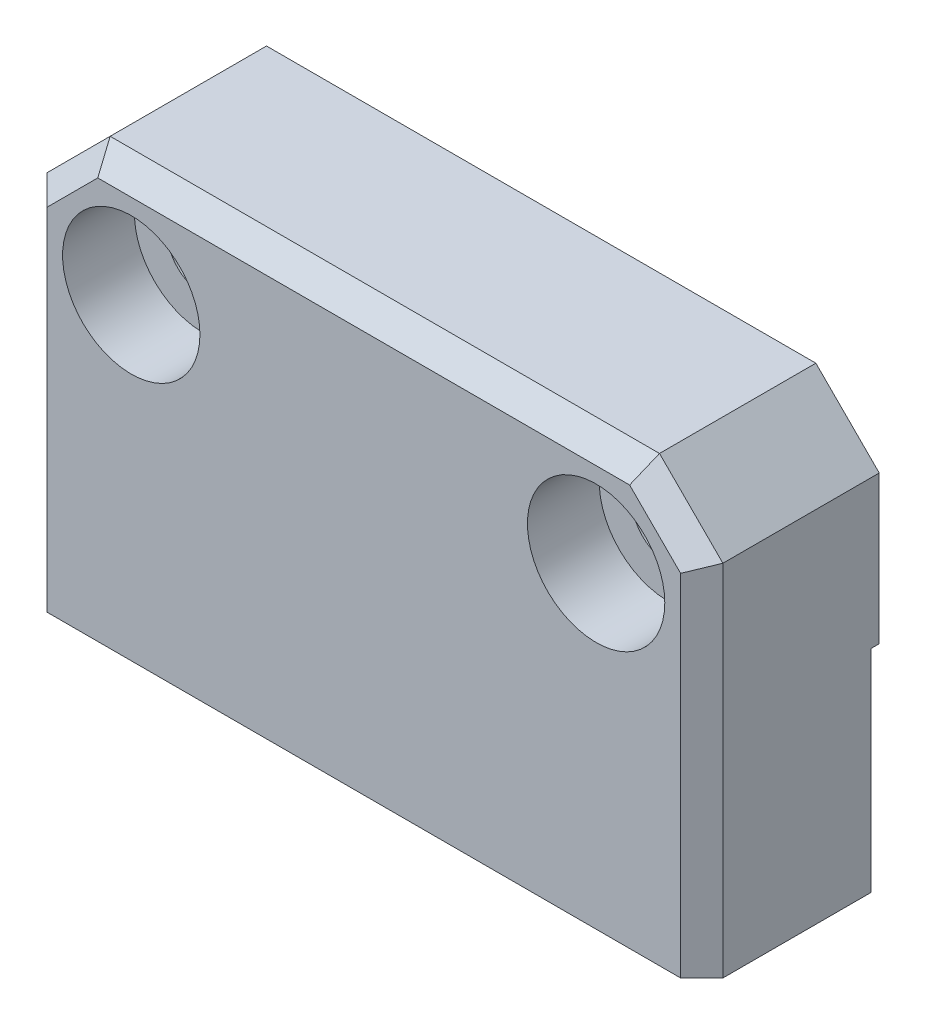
ISO-10303-21;
HEADER;
FILE_DESCRIPTION(('STEP AP214'),'2;1');
FILE_NAME('part.step','',(''),(''),'','','');
FILE_SCHEMA(('AUTOMOTIVE_DESIGN { 1 0 10303 214 1 1 1 1 }'));
ENDSEC;
DATA;
#1=APPLICATION_CONTEXT('core data for automotive mechanical design processes');
#2=APPLICATION_PROTOCOL_DEFINITION('international standard','automotive_design',2000,#1);
#3=PRODUCT_CONTEXT('',#1,'mechanical');
#4=PRODUCT('Part','Part','',(#3));
#5=PRODUCT_RELATED_PRODUCT_CATEGORY('part','',(#4));
#6=PRODUCT_DEFINITION_FORMATION('','',#4);
#7=PRODUCT_DEFINITION_CONTEXT('part definition',#1,'design');
#8=PRODUCT_DEFINITION('design','',#6,#7);
#9=PRODUCT_DEFINITION_SHAPE('','',#8);
#10=(LENGTH_UNIT() NAMED_UNIT(*) SI_UNIT(.MILLI.,.METRE.));
#11=(NAMED_UNIT(*) PLANE_ANGLE_UNIT() SI_UNIT($,.RADIAN.));
#12=(NAMED_UNIT(*) SI_UNIT($,.STERADIAN.) SOLID_ANGLE_UNIT());
#13=UNCERTAINTY_MEASURE_WITH_UNIT(LENGTH_MEASURE(1.E-05),#10,'distance_accuracy_value','');
#14=(GEOMETRIC_REPRESENTATION_CONTEXT(3) GLOBAL_UNCERTAINTY_ASSIGNED_CONTEXT((#13)) GLOBAL_UNIT_ASSIGNED_CONTEXT((#10,
#11,#12)) REPRESENTATION_CONTEXT('',''));
#15=CARTESIAN_POINT('',(0.,0.,0.));
#16=DIRECTION('',(0.,0.,1.));
#17=DIRECTION('',(1.,0.,0.));
#18=AXIS2_PLACEMENT_3D('',#15,#16,#17);
#19=CARTESIAN_POINT('',(0.,0.,0.));
#20=DIRECTION('',(0.,0.,-1.));
#21=DIRECTION('',(-1.,0.,0.));
#22=AXIS2_PLACEMENT_3D('',#19,#20,#21);
#23=PLANE('',#22);
#24=DIRECTION('',(-1.,0.,0.));
#25=VECTOR('',#24,1.);
#26=CARTESIAN_POINT('',(0.,0.,0.));
#27=LINE('',#26,#25);
#28=CARTESIAN_POINT('',(-13.85,0.,0.));
#29=VERTEX_POINT('',#28);
#30=CARTESIAN_POINT('',(-14.15,0.,0.));
#31=VERTEX_POINT('',#30);
#32=EDGE_CURVE('E403',#29,#31,#27,.T.);
#33=ORIENTED_EDGE('',*,*,#32,.F.);
#34=DIRECTION('',(0.,1.,0.));
#35=VECTOR('',#34,1.);
#36=CARTESIAN_POINT('',(-13.85,-10.,0.));
#37=LINE('',#36,#35);
#38=CARTESIAN_POINT('',(-13.85,-10.,0.));
#39=VERTEX_POINT('',#38);
#40=EDGE_CURVE('E546',#39,#29,#37,.T.);
#41=ORIENTED_EDGE('',*,*,#40,.F.);
#42=DIRECTION('',(1.,0.,0.));
#43=VECTOR('',#42,1.);
#44=CARTESIAN_POINT('',(-16.,-10.,0.));
#45=LINE('',#44,#43);
#46=CARTESIAN_POINT('',(-14.15,-10.,0.));
#47=VERTEX_POINT('',#46);
#48=EDGE_CURVE('E615',#47,#39,#45,.T.);
#49=ORIENTED_EDGE('',*,*,#48,.F.);
#50=DIRECTION('',(0.,1.,0.));
#51=VECTOR('',#50,1.);
#52=CARTESIAN_POINT('',(-14.15,-10.,0.));
#53=LINE('',#52,#51);
#54=EDGE_CURVE('E621',#31,#47,#53,.F.);
#55=ORIENTED_EDGE('',*,*,#54,.F.);
#56=EDGE_LOOP('',(#33,#41,#49,#55));
#57=FACE_BOUND('',#56,.T.);
#58=ADVANCED_FACE('F40',(#57),#23,.T.);
#59=DIRECTION('',(-1.,0.,0.));
#60=VECTOR('',#59,1.);
#61=CARTESIAN_POINT('',(0.,0.,0.));
#62=LINE('',#61,#60);
#63=CARTESIAN_POINT('',(-11.85,0.,0.));
#64=VERTEX_POINT('',#63);
#65=CARTESIAN_POINT('',(-12.15,0.,0.));
#66=VERTEX_POINT('',#65);
#67=EDGE_CURVE('E389',#64,#66,#62,.T.);
#68=ORIENTED_EDGE('',*,*,#67,.F.);
#69=DIRECTION('',(0.,1.,0.));
#70=VECTOR('',#69,1.);
#71=CARTESIAN_POINT('',(-11.85,-10.,0.));
#72=LINE('',#71,#70);
#73=CARTESIAN_POINT('',(-11.85,-10.,0.));
#74=VERTEX_POINT('',#73);
#75=EDGE_CURVE('E539',#74,#64,#72,.T.);
#76=ORIENTED_EDGE('',*,*,#75,.F.);
#77=CARTESIAN_POINT('',(-12.15,-10.,0.));
#78=VERTEX_POINT('',#77);
#79=EDGE_CURVE('E842',#78,#74,#45,.T.);
#80=ORIENTED_EDGE('',*,*,#79,.F.);
#81=DIRECTION('',(0.,1.,0.));
#82=VECTOR('',#81,1.);
#83=CARTESIAN_POINT('',(-12.15,-10.,0.));
#84=LINE('',#83,#82);
#85=EDGE_CURVE('E543',#66,#78,#84,.F.);
#86=ORIENTED_EDGE('',*,*,#85,.F.);
#87=EDGE_LOOP('',(#68,#76,#80,#86));
#88=FACE_BOUND('',#87,.T.);
#89=ADVANCED_FACE('F793',(#88),#23,.T.);
#90=DIRECTION('',(-1.,0.,0.));
#91=VECTOR('',#90,1.);
#92=CARTESIAN_POINT('',(0.,0.,0.));
#93=LINE('',#92,#91);
#94=CARTESIAN_POINT('',(-9.85,0.,0.));
#95=VERTEX_POINT('',#94);
#96=CARTESIAN_POINT('',(-10.15,0.,0.));
#97=VERTEX_POINT('',#96);
#98=EDGE_CURVE('E375',#95,#97,#93,.T.);
#99=ORIENTED_EDGE('',*,*,#98,.F.);
#100=DIRECTION('',(0.,1.,0.));
#101=VECTOR('',#100,1.);
#102=CARTESIAN_POINT('',(-9.85,-10.,0.));
#103=LINE('',#102,#101);
#104=CARTESIAN_POINT('',(-9.85,-10.,0.));
#105=VERTEX_POINT('',#104);
#106=EDGE_CURVE('E474',#105,#95,#103,.T.);
#107=ORIENTED_EDGE('',*,*,#106,.F.);
#108=CARTESIAN_POINT('',(-10.15,-10.,0.));
#109=VERTEX_POINT('',#108);
#110=EDGE_CURVE('E846',#109,#105,#45,.T.);
#111=ORIENTED_EDGE('',*,*,#110,.F.);
#112=DIRECTION('',(0.,1.,0.));
#113=VECTOR('',#112,1.);
#114=CARTESIAN_POINT('',(-10.15,-10.,0.));
#115=LINE('',#114,#113);
#116=EDGE_CURVE('E536',#97,#109,#115,.F.);
#117=ORIENTED_EDGE('',*,*,#116,.F.);
#118=EDGE_LOOP('',(#99,#107,#111,#117));
#119=FACE_BOUND('',#118,.T.);
#120=ADVANCED_FACE('F800',(#119),#23,.T.);
#121=DIRECTION('',(-1.,0.,0.));
#122=VECTOR('',#121,1.);
#123=CARTESIAN_POINT('',(0.,0.,0.));
#124=LINE('',#123,#122);
#125=CARTESIAN_POINT('',(-7.85,0.,0.));
#126=VERTEX_POINT('',#125);
#127=CARTESIAN_POINT('',(-8.15,0.,0.));
#128=VERTEX_POINT('',#127);
#129=EDGE_CURVE('E361',#126,#128,#124,.T.);
#130=ORIENTED_EDGE('',*,*,#129,.F.);
#131=DIRECTION('',(0.,1.,0.));
#132=VECTOR('',#131,1.);
#133=CARTESIAN_POINT('',(-7.85,-10.,0.));
#134=LINE('',#133,#132);
#135=CARTESIAN_POINT('',(-7.85,-10.,0.));
#136=VERTEX_POINT('',#135);
#137=EDGE_CURVE('E687',#136,#126,#134,.T.);
#138=ORIENTED_EDGE('',*,*,#137,.F.);
#139=CARTESIAN_POINT('',(-8.15,-10.,0.));
#140=VERTEX_POINT('',#139);
#141=EDGE_CURVE('E851',#140,#136,#45,.T.);
#142=ORIENTED_EDGE('',*,*,#141,.F.);
#143=DIRECTION('',(0.,1.,0.));
#144=VECTOR('',#143,1.);
#145=CARTESIAN_POINT('',(-8.15,-10.,0.));
#146=LINE('',#145,#144);
#147=EDGE_CURVE('E533',#128,#140,#146,.F.);
#148=ORIENTED_EDGE('',*,*,#147,.F.);
#149=EDGE_LOOP('',(#130,#138,#142,#148));
#150=FACE_BOUND('',#149,.T.);
#151=ADVANCED_FACE('F998',(#150),#23,.T.);
#152=DIRECTION('',(-1.,0.,0.));
#153=VECTOR('',#152,1.);
#154=CARTESIAN_POINT('',(0.,0.,0.));
#155=LINE('',#154,#153);
#156=CARTESIAN_POINT('',(-5.85,0.,0.));
#157=VERTEX_POINT('',#156);
#158=CARTESIAN_POINT('',(-6.15,0.,0.));
#159=VERTEX_POINT('',#158);
#160=EDGE_CURVE('E357',#157,#159,#155,.T.);
#161=ORIENTED_EDGE('',*,*,#160,.F.);
#162=DIRECTION('',(0.,1.,0.));
#163=VECTOR('',#162,1.);
#164=CARTESIAN_POINT('',(-5.85,-10.,0.));
#165=LINE('',#164,#163);
#166=CARTESIAN_POINT('',(-5.85,-10.,0.));
#167=VERTEX_POINT('',#166);
#168=EDGE_CURVE('E680',#167,#157,#165,.T.);
#169=ORIENTED_EDGE('',*,*,#168,.F.);
#170=CARTESIAN_POINT('',(-6.15,-10.,0.));
#171=VERTEX_POINT('',#170);
#172=EDGE_CURVE('E856',#171,#167,#45,.T.);
#173=ORIENTED_EDGE('',*,*,#172,.F.);
#174=DIRECTION('',(0.,1.,0.));
#175=VECTOR('',#174,1.);
#176=CARTESIAN_POINT('',(-6.15,-10.,0.));
#177=LINE('',#176,#175);
#178=EDGE_CURVE('E684',#159,#171,#177,.F.);
#179=ORIENTED_EDGE('',*,*,#178,.F.);
#180=EDGE_LOOP('',(#161,#169,#173,#179));
#181=FACE_BOUND('',#180,.T.);
#182=ADVANCED_FACE('F992',(#181),#23,.T.);
#183=DIRECTION('',(-1.,0.,0.));
#184=VECTOR('',#183,1.);
#185=CARTESIAN_POINT('',(0.,0.,0.));
#186=LINE('',#185,#184);
#187=CARTESIAN_POINT('',(-3.85,0.,0.));
#188=VERTEX_POINT('',#187);
#189=CARTESIAN_POINT('',(-4.15,0.,0.));
#190=VERTEX_POINT('',#189);
#191=EDGE_CURVE('E372',#188,#190,#186,.T.);
#192=ORIENTED_EDGE('',*,*,#191,.F.);
#193=DIRECTION('',(0.,1.,0.));
#194=VECTOR('',#193,1.);
#195=CARTESIAN_POINT('',(-3.85,-10.,0.));
#196=LINE('',#195,#194);
#197=CARTESIAN_POINT('',(-3.85,-10.,0.));
#198=VERTEX_POINT('',#197);
#199=EDGE_CURVE('E673',#198,#188,#196,.T.);
#200=ORIENTED_EDGE('',*,*,#199,.F.);
#201=CARTESIAN_POINT('',(-4.15,-10.,0.));
#202=VERTEX_POINT('',#201);
#203=EDGE_CURVE('E861',#202,#198,#45,.T.);
#204=ORIENTED_EDGE('',*,*,#203,.F.);
#205=DIRECTION('',(0.,1.,0.));
#206=VECTOR('',#205,1.);
#207=CARTESIAN_POINT('',(-4.15,-10.,0.));
#208=LINE('',#207,#206);
#209=EDGE_CURVE('E677',#190,#202,#208,.F.);
#210=ORIENTED_EDGE('',*,*,#209,.F.);
#211=EDGE_LOOP('',(#192,#200,#204,#210));
#212=FACE_BOUND('',#211,.T.);
#213=ADVANCED_FACE('F985',(#212),#23,.T.);
#214=DIRECTION('',(-1.,0.,0.));
#215=VECTOR('',#214,1.);
#216=CARTESIAN_POINT('',(0.,0.,0.));
#217=LINE('',#216,#215);
#218=CARTESIAN_POINT('',(-1.85,0.,0.));
#219=VERTEX_POINT('',#218);
#220=CARTESIAN_POINT('',(-2.15,0.,0.));
#221=VERTEX_POINT('',#220);
#222=EDGE_CURVE('E386',#219,#221,#217,.T.);
#223=ORIENTED_EDGE('',*,*,#222,.F.);
#224=DIRECTION('',(0.,1.,0.));
#225=VECTOR('',#224,1.);
#226=CARTESIAN_POINT('',(-1.85,-10.,0.));
#227=LINE('',#226,#225);
#228=CARTESIAN_POINT('',(-1.85,-10.,0.));
#229=VERTEX_POINT('',#228);
#230=EDGE_CURVE('E666',#229,#219,#227,.T.);
#231=ORIENTED_EDGE('',*,*,#230,.F.);
#232=CARTESIAN_POINT('',(-2.15,-10.,0.));
#233=VERTEX_POINT('',#232);
#234=EDGE_CURVE('E866',#233,#229,#45,.T.);
#235=ORIENTED_EDGE('',*,*,#234,.F.);
#236=DIRECTION('',(0.,1.,0.));
#237=VECTOR('',#236,1.);
#238=CARTESIAN_POINT('',(-2.15,-10.,0.));
#239=LINE('',#238,#237);
#240=EDGE_CURVE('E670',#221,#233,#239,.F.);
#241=ORIENTED_EDGE('',*,*,#240,.F.);
#242=EDGE_LOOP('',(#223,#231,#235,#241));
#243=FACE_BOUND('',#242,.T.);
#244=ADVANCED_FACE('F978',(#243),#23,.T.);
#245=DIRECTION('',(-1.,0.,0.));
#246=VECTOR('',#245,1.);
#247=CARTESIAN_POINT('',(0.,0.,0.));
#248=LINE('',#247,#246);
#249=CARTESIAN_POINT('',(0.149999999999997,0.,0.));
#250=VERTEX_POINT('',#249);
#251=CARTESIAN_POINT('',(-0.150000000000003,0.,0.));
#252=VERTEX_POINT('',#251);
#253=EDGE_CURVE('E400',#250,#252,#248,.T.);
#254=ORIENTED_EDGE('',*,*,#253,.F.);
#255=DIRECTION('',(0.,1.,0.));
#256=VECTOR('',#255,1.);
#257=CARTESIAN_POINT('',(0.149999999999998,-10.,0.));
#258=LINE('',#257,#256);
#259=CARTESIAN_POINT('',(0.149999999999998,-10.,0.));
#260=VERTEX_POINT('',#259);
#261=EDGE_CURVE('E659',#260,#250,#258,.T.);
#262=ORIENTED_EDGE('',*,*,#261,.F.);
#263=CARTESIAN_POINT('',(-0.150000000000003,-10.,0.));
#264=VERTEX_POINT('',#263);
#265=EDGE_CURVE('E871',#264,#260,#45,.T.);
#266=ORIENTED_EDGE('',*,*,#265,.F.);
#267=DIRECTION('',(0.,1.,0.));
#268=VECTOR('',#267,1.);
#269=CARTESIAN_POINT('',(-0.150000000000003,-10.,0.));
#270=LINE('',#269,#268);
#271=EDGE_CURVE('E663',#252,#264,#270,.F.);
#272=ORIENTED_EDGE('',*,*,#271,.F.);
#273=EDGE_LOOP('',(#254,#262,#266,#272));
#274=FACE_BOUND('',#273,.T.);
#275=ADVANCED_FACE('F971',(#274),#23,.T.);
#276=DIRECTION('',(-1.,0.,0.));
#277=VECTOR('',#276,1.);
#278=CARTESIAN_POINT('',(0.,0.,0.));
#279=LINE('',#278,#277);
#280=CARTESIAN_POINT('',(2.15,0.,0.));
#281=VERTEX_POINT('',#280);
#282=CARTESIAN_POINT('',(1.85,0.,0.));
#283=VERTEX_POINT('',#282);
#284=EDGE_CURVE('E417',#281,#283,#279,.T.);
#285=ORIENTED_EDGE('',*,*,#284,.F.);
#286=DIRECTION('',(0.,1.,0.));
#287=VECTOR('',#286,1.);
#288=CARTESIAN_POINT('',(2.15,-10.,0.));
#289=LINE('',#288,#287);
#290=CARTESIAN_POINT('',(2.15,-10.,0.));
#291=VERTEX_POINT('',#290);
#292=EDGE_CURVE('E652',#291,#281,#289,.T.);
#293=ORIENTED_EDGE('',*,*,#292,.F.);
#294=CARTESIAN_POINT('',(1.85,-10.,0.));
#295=VERTEX_POINT('',#294);
#296=EDGE_CURVE('E876',#295,#291,#45,.T.);
#297=ORIENTED_EDGE('',*,*,#296,.F.);
#298=DIRECTION('',(0.,1.,0.));
#299=VECTOR('',#298,1.);
#300=CARTESIAN_POINT('',(1.85,-10.,0.));
#301=LINE('',#300,#299);
#302=EDGE_CURVE('E656',#283,#295,#301,.F.);
#303=ORIENTED_EDGE('',*,*,#302,.F.);
#304=EDGE_LOOP('',(#285,#293,#297,#303));
#305=FACE_BOUND('',#304,.T.);
#306=ADVANCED_FACE('F964',(#305),#23,.T.);
#307=DIRECTION('',(-1.,0.,0.));
#308=VECTOR('',#307,1.);
#309=CARTESIAN_POINT('',(0.,0.,0.));
#310=LINE('',#309,#308);
#311=CARTESIAN_POINT('',(4.15,0.,0.));
#312=VERTEX_POINT('',#311);
#313=CARTESIAN_POINT('',(3.85,0.,0.));
#314=VERTEX_POINT('',#313);
#315=EDGE_CURVE('E424',#312,#314,#310,.T.);
#316=ORIENTED_EDGE('',*,*,#315,.F.);
#317=DIRECTION('',(0.,1.,0.));
#318=VECTOR('',#317,1.);
#319=CARTESIAN_POINT('',(4.15,-10.,0.));
#320=LINE('',#319,#318);
#321=CARTESIAN_POINT('',(4.15,-10.,0.));
#322=VERTEX_POINT('',#321);
#323=EDGE_CURVE('E645',#322,#312,#320,.T.);
#324=ORIENTED_EDGE('',*,*,#323,.F.);
#325=CARTESIAN_POINT('',(3.85,-10.,0.));
#326=VERTEX_POINT('',#325);
#327=EDGE_CURVE('E881',#326,#322,#45,.T.);
#328=ORIENTED_EDGE('',*,*,#327,.F.);
#329=DIRECTION('',(0.,1.,0.));
#330=VECTOR('',#329,1.);
#331=CARTESIAN_POINT('',(3.85,-10.,0.));
#332=LINE('',#331,#330);
#333=EDGE_CURVE('E649',#314,#326,#332,.F.);
#334=ORIENTED_EDGE('',*,*,#333,.F.);
#335=EDGE_LOOP('',(#316,#324,#328,#334));
#336=FACE_BOUND('',#335,.T.);
#337=ADVANCED_FACE('F957',(#336),#23,.T.);
#338=DIRECTION('',(-1.,0.,0.));
#339=VECTOR('',#338,1.);
#340=CARTESIAN_POINT('',(0.,0.,0.));
#341=LINE('',#340,#339);
#342=CARTESIAN_POINT('',(6.15,0.,0.));
#343=VERTEX_POINT('',#342);
#344=CARTESIAN_POINT('',(5.85,0.,0.));
#345=VERTEX_POINT('',#344);
#346=EDGE_CURVE('E431',#343,#345,#341,.T.);
#347=ORIENTED_EDGE('',*,*,#346,.F.);
#348=DIRECTION('',(0.,1.,0.));
#349=VECTOR('',#348,1.);
#350=CARTESIAN_POINT('',(6.15,-10.,0.));
#351=LINE('',#350,#349);
#352=CARTESIAN_POINT('',(6.15,-10.,0.));
#353=VERTEX_POINT('',#352);
#354=EDGE_CURVE('E638',#353,#343,#351,.T.);
#355=ORIENTED_EDGE('',*,*,#354,.F.);
#356=CARTESIAN_POINT('',(5.85,-10.,0.));
#357=VERTEX_POINT('',#356);
#358=EDGE_CURVE('E886',#357,#353,#45,.T.);
#359=ORIENTED_EDGE('',*,*,#358,.F.);
#360=DIRECTION('',(0.,1.,0.));
#361=VECTOR('',#360,1.);
#362=CARTESIAN_POINT('',(5.85,-10.,0.));
#363=LINE('',#362,#361);
#364=EDGE_CURVE('E642',#345,#357,#363,.F.);
#365=ORIENTED_EDGE('',*,*,#364,.F.);
#366=EDGE_LOOP('',(#347,#355,#359,#365));
#367=FACE_BOUND('',#366,.T.);
#368=ADVANCED_FACE('F950',(#367),#23,.T.);
#369=DIRECTION('',(-1.,0.,0.));
#370=VECTOR('',#369,1.);
#371=CARTESIAN_POINT('',(0.,0.,0.));
#372=LINE('',#371,#370);
#373=CARTESIAN_POINT('',(8.15,0.,0.));
#374=VERTEX_POINT('',#373);
#375=CARTESIAN_POINT('',(7.85,0.,0.));
#376=VERTEX_POINT('',#375);
#377=EDGE_CURVE('E438',#374,#376,#372,.T.);
#378=ORIENTED_EDGE('',*,*,#377,.F.);
#379=DIRECTION('',(0.,1.,0.));
#380=VECTOR('',#379,1.);
#381=CARTESIAN_POINT('',(8.15,-10.,0.));
#382=LINE('',#381,#380);
#383=CARTESIAN_POINT('',(8.15,-10.,0.));
#384=VERTEX_POINT('',#383);
#385=EDGE_CURVE('E567',#384,#374,#382,.T.);
#386=ORIENTED_EDGE('',*,*,#385,.F.);
#387=CARTESIAN_POINT('',(7.85,-10.,0.));
#388=VERTEX_POINT('',#387);
#389=EDGE_CURVE('E891',#388,#384,#45,.T.);
#390=ORIENTED_EDGE('',*,*,#389,.F.);
#391=DIRECTION('',(0.,1.,0.));
#392=VECTOR('',#391,1.);
#393=CARTESIAN_POINT('',(7.85,-10.,0.));
#394=LINE('',#393,#392);
#395=EDGE_CURVE('E635',#376,#388,#394,.F.);
#396=ORIENTED_EDGE('',*,*,#395,.F.);
#397=EDGE_LOOP('',(#378,#386,#390,#396));
#398=FACE_BOUND('',#397,.T.);
#399=ADVANCED_FACE('F943',(#398),#23,.T.);
#400=DIRECTION('',(-1.,0.,0.));
#401=VECTOR('',#400,1.);
#402=CARTESIAN_POINT('',(0.,0.,0.));
#403=LINE('',#402,#401);
#404=CARTESIAN_POINT('',(10.15,0.,0.));
#405=VERTEX_POINT('',#404);
#406=CARTESIAN_POINT('',(9.85,0.,0.));
#407=VERTEX_POINT('',#406);
#408=EDGE_CURVE('E445',#405,#407,#403,.T.);
#409=ORIENTED_EDGE('',*,*,#408,.F.);
#410=DIRECTION('',(0.,1.,0.));
#411=VECTOR('',#410,1.);
#412=CARTESIAN_POINT('',(10.15,-10.,0.));
#413=LINE('',#412,#411);
#414=CARTESIAN_POINT('',(10.15,-10.,0.));
#415=VERTEX_POINT('',#414);
#416=EDGE_CURVE('E560',#415,#405,#413,.T.);
#417=ORIENTED_EDGE('',*,*,#416,.F.);
#418=CARTESIAN_POINT('',(9.85,-10.,0.));
#419=VERTEX_POINT('',#418);
#420=EDGE_CURVE('E896',#419,#415,#45,.T.);
#421=ORIENTED_EDGE('',*,*,#420,.F.);
#422=DIRECTION('',(0.,1.,0.));
#423=VECTOR('',#422,1.);
#424=CARTESIAN_POINT('',(9.85,-10.,0.));
#425=LINE('',#424,#423);
#426=EDGE_CURVE('E564',#407,#419,#425,.F.);
#427=ORIENTED_EDGE('',*,*,#426,.F.);
#428=EDGE_LOOP('',(#409,#417,#421,#427));
#429=FACE_BOUND('',#428,.T.);
#430=ADVANCED_FACE('F936',(#429),#23,.T.);
#431=DIRECTION('',(-1.,0.,0.));
#432=VECTOR('',#431,1.);
#433=CARTESIAN_POINT('',(0.,0.,0.));
#434=LINE('',#433,#432);
#435=CARTESIAN_POINT('',(12.15,0.,0.));
#436=VERTEX_POINT('',#435);
#437=CARTESIAN_POINT('',(11.85,0.,0.));
#438=VERTEX_POINT('',#437);
#439=EDGE_CURVE('E452',#436,#438,#434,.T.);
#440=ORIENTED_EDGE('',*,*,#439,.F.);
#441=DIRECTION('',(0.,1.,0.));
#442=VECTOR('',#441,1.);
#443=CARTESIAN_POINT('',(12.15,-10.,0.));
#444=LINE('',#443,#442);
#445=CARTESIAN_POINT('',(12.15,-10.,0.));
#446=VERTEX_POINT('',#445);
#447=EDGE_CURVE('E550',#446,#436,#444,.T.);
#448=ORIENTED_EDGE('',*,*,#447,.F.);
#449=CARTESIAN_POINT('',(11.85,-10.,0.));
#450=VERTEX_POINT('',#449);
#451=EDGE_CURVE('E901',#450,#446,#45,.T.);
#452=ORIENTED_EDGE('',*,*,#451,.F.);
#453=DIRECTION('',(0.,1.,0.));
#454=VECTOR('',#453,1.);
#455=CARTESIAN_POINT('',(11.85,-10.,0.));
#456=LINE('',#455,#454);
#457=EDGE_CURVE('E557',#438,#450,#456,.F.);
#458=ORIENTED_EDGE('',*,*,#457,.F.);
#459=EDGE_LOOP('',(#440,#448,#452,#458));
#460=FACE_BOUND('',#459,.T.);
#461=ADVANCED_FACE('F827',(#460),#23,.T.);
#462=DIRECTION('',(-1.,0.,0.));
#463=VECTOR('',#462,1.);
#464=CARTESIAN_POINT('',(0.,0.,0.));
#465=LINE('',#464,#463);
#466=CARTESIAN_POINT('',(14.15,0.,0.));
#467=VERTEX_POINT('',#466);
#468=CARTESIAN_POINT('',(13.85,0.,0.));
#469=VERTEX_POINT('',#468);
#470=EDGE_CURVE('E459',#467,#469,#465,.T.);
#471=ORIENTED_EDGE('',*,*,#470,.F.);
#472=DIRECTION('',(0.,1.,0.));
#473=VECTOR('',#472,1.);
#474=CARTESIAN_POINT('',(14.15,-10.,0.));
#475=LINE('',#474,#473);
#476=CARTESIAN_POINT('',(14.15,-10.,0.));
#477=VERTEX_POINT('',#476);
#478=EDGE_CURVE('E631',#477,#467,#475,.T.);
#479=ORIENTED_EDGE('',*,*,#478,.F.);
#480=CARTESIAN_POINT('',(13.85,-10.,0.));
#481=VERTEX_POINT('',#480);
#482=EDGE_CURVE('E906',#481,#477,#45,.T.);
#483=ORIENTED_EDGE('',*,*,#482,.F.);
#484=DIRECTION('',(0.,1.,0.));
#485=VECTOR('',#484,1.);
#486=CARTESIAN_POINT('',(13.85,-10.,0.));
#487=LINE('',#486,#485);
#488=EDGE_CURVE('E554',#469,#481,#487,.F.);
#489=ORIENTED_EDGE('',*,*,#488,.F.);
#490=EDGE_LOOP('',(#471,#479,#483,#489));
#491=FACE_BOUND('',#490,.T.);
#492=ADVANCED_FACE('F819',(#491),#23,.T.);
#493=DIRECTION('',(-1.,0.,0.));
#494=VECTOR('',#493,1.);
#495=CARTESIAN_POINT('',(0.,0.,0.));
#496=LINE('',#495,#494);
#497=CARTESIAN_POINT('',(-15.85,0.,0.));
#498=VERTEX_POINT('',#497);
#499=CARTESIAN_POINT('',(-16.,0.,0.));
#500=VERTEX_POINT('',#499);
#501=EDGE_CURVE('E414',#498,#500,#496,.T.);
#502=ORIENTED_EDGE('',*,*,#501,.F.);
#503=DIRECTION('',(0.,1.,0.));
#504=VECTOR('',#503,1.);
#505=CARTESIAN_POINT('',(-15.85,-10.,0.));
#506=LINE('',#505,#504);
#507=CARTESIAN_POINT('',(-15.85,-10.,0.));
#508=VERTEX_POINT('',#507);
#509=EDGE_CURVE('E624',#508,#498,#506,.T.);
#510=ORIENTED_EDGE('',*,*,#509,.F.);
#511=CARTESIAN_POINT('',(-16.,-10.,0.));
#512=VERTEX_POINT('',#511);
#513=EDGE_CURVE('E604',#512,#508,#45,.T.);
#514=ORIENTED_EDGE('',*,*,#513,.F.);
#515=DIRECTION('',(0.,-1.,0.));
#516=VECTOR('',#515,1.);
#517=CARTESIAN_POINT('',(-16.,-10.,0.));
#518=LINE('',#517,#516);
#519=EDGE_CURVE('E607',#500,#512,#518,.T.);
#520=ORIENTED_EDGE('',*,*,#519,.F.);
#521=EDGE_LOOP('',(#502,#510,#514,#520));
#522=FACE_BOUND('',#521,.T.);
#523=ADVANCED_FACE('F809',(#522),#23,.T.);
#524=CARTESIAN_POINT('',(16.,-10.,8.));
#525=DIRECTION('',(-1.,0.,0.));
#526=DIRECTION('',(0.,0.,1.));
#527=AXIS2_PLACEMENT_3D('',#524,#525,#526);
#528=PLANE('',#527);
#529=DIRECTION('',(0.,0.,1.));
#530=VECTOR('',#529,1.);
#531=CARTESIAN_POINT('',(16.,6.99999999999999,8.));
#532=LINE('',#531,#530);
#533=CARTESIAN_POINT('',(16.,6.99999999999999,-0.4));
#534=VERTEX_POINT('',#533);
#535=CARTESIAN_POINT('',(16.,6.99999999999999,6.99999999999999));
#536=VERTEX_POINT('',#535);
#537=EDGE_CURVE('E709',#534,#536,#532,.T.);
#538=ORIENTED_EDGE('',*,*,#537,.T.);
#539=DIRECTION('',(0.,-1.,0.));
#540=VECTOR('',#539,1.);
#541=CARTESIAN_POINT('',(16.,-10.,6.99999999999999));
#542=LINE('',#541,#540);
#543=CARTESIAN_POINT('',(16.,-10.,6.99999999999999));
#544=VERTEX_POINT('',#543);
#545=EDGE_CURVE('E740',#536,#544,#542,.T.);
#546=ORIENTED_EDGE('',*,*,#545,.T.);
#547=DIRECTION('',(0.,0.,-1.));
#548=VECTOR('',#547,1.);
#549=CARTESIAN_POINT('',(16.,-10.,8.));
#550=LINE('',#549,#548);
#551=CARTESIAN_POINT('',(16.,-10.,0.));
#552=VERTEX_POINT('',#551);
#553=EDGE_CURVE('E603',#544,#552,#550,.T.);
#554=ORIENTED_EDGE('',*,*,#553,.T.);
#555=DIRECTION('',(0.,1.,0.));
#556=VECTOR('',#555,1.);
#557=CARTESIAN_POINT('',(16.,-10.,0.));
#558=LINE('',#557,#556);
#559=CARTESIAN_POINT('',(16.,0.,0.));
#560=VERTEX_POINT('',#559);
#561=EDGE_CURVE('E337',#552,#560,#558,.T.);
#562=ORIENTED_EDGE('',*,*,#561,.T.);
#563=DIRECTION('',(0.,0.,-1.));
#564=VECTOR('',#563,1.);
#565=CARTESIAN_POINT('',(16.,0.,1.));
#566=LINE('',#565,#564);
#567=CARTESIAN_POINT('',(16.,0.,-0.4));
#568=VERTEX_POINT('',#567);
#569=EDGE_CURVE('E334',#560,#568,#566,.T.);
#570=ORIENTED_EDGE('',*,*,#569,.T.);
#571=DIRECTION('',(0.,-1.,0.));
#572=VECTOR('',#571,1.);
#573=CARTESIAN_POINT('',(16.,10.,-0.4));
#574=LINE('',#573,#572);
#575=EDGE_CURVE('E318',#534,#568,#574,.T.);
#576=ORIENTED_EDGE('',*,*,#575,.F.);
#577=EDGE_LOOP('',(#538,#546,#554,#562,#570,#576));
#578=FACE_BOUND('',#577,.T.);
#579=ADVANCED_FACE('F335',(#578),#528,.F.);
#580=CARTESIAN_POINT('',(-16.,10.,8.));
#581=DIRECTION('',(0.,-1.,0.));
#582=DIRECTION('',(0.,0.,-1.));
#583=AXIS2_PLACEMENT_3D('',#580,#581,#582);
#584=PLANE('',#583);
#585=DIRECTION('',(0.,0.,1.));
#586=VECTOR('',#585,1.);
#587=CARTESIAN_POINT('',(-13.,10.,8.));
#588=LINE('',#587,#586);
#589=CARTESIAN_POINT('',(-13.,10.,-0.4));
#590=VERTEX_POINT('',#589);
#591=CARTESIAN_POINT('',(-13.,10.,6.99999999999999));
#592=VERTEX_POINT('',#591);
#593=EDGE_CURVE('E706',#590,#592,#588,.T.);
#594=ORIENTED_EDGE('',*,*,#593,.T.);
#595=DIRECTION('',(1.,0.,0.));
#596=VECTOR('',#595,1.);
#597=CARTESIAN_POINT('',(-16.,10.,6.99999999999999));
#598=LINE('',#597,#596);
#599=CARTESIAN_POINT('',(13.,10.,6.99999999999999));
#600=VERTEX_POINT('',#599);
#601=EDGE_CURVE('E11',#592,#600,#598,.T.);
#602=ORIENTED_EDGE('',*,*,#601,.T.);
#603=DIRECTION('',(0.,0.,-1.));
#604=VECTOR('',#603,1.);
#605=CARTESIAN_POINT('',(13.,10.,8.));
#606=LINE('',#605,#604);
#607=CARTESIAN_POINT('',(13.,10.,-0.4));
#608=VERTEX_POINT('',#607);
#609=EDGE_CURVE('E703',#600,#608,#606,.T.);
#610=ORIENTED_EDGE('',*,*,#609,.T.);
#611=DIRECTION('',(1.,0.,0.));
#612=VECTOR('',#611,1.);
#613=CARTESIAN_POINT('',(16.,10.,-0.4));
#614=LINE('',#613,#612);
#615=EDGE_CURVE('E342',#590,#608,#614,.T.);
#616=ORIENTED_EDGE('',*,*,#615,.F.);
#617=EDGE_LOOP('',(#594,#602,#610,#616));
#618=FACE_BOUND('',#617,.T.);
#619=ADVANCED_FACE('F825',(#618),#584,.F.);
#620=CARTESIAN_POINT('',(-16.,-10.,8.));
#621=DIRECTION('',(1.,0.,0.));
#622=DIRECTION('',(0.,0.,-1.));
#623=AXIS2_PLACEMENT_3D('',#620,#621,#622);
#624=PLANE('',#623);
#625=DIRECTION('',(0.,0.,-1.));
#626=VECTOR('',#625,1.);
#627=CARTESIAN_POINT('',(-16.,-10.,8.));
#628=LINE('',#627,#626);
#629=CARTESIAN_POINT('',(-16.,-10.,6.99999999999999));
#630=VERTEX_POINT('',#629);
#631=EDGE_CURVE('E618',#630,#512,#628,.T.);
#632=ORIENTED_EDGE('',*,*,#631,.F.);
#633=DIRECTION('',(0.,1.,0.));
#634=VECTOR('',#633,1.);
#635=CARTESIAN_POINT('',(-16.,-10.,6.99999999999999));
#636=LINE('',#635,#634);
#637=CARTESIAN_POINT('',(-16.,6.99999999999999,6.99999999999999));
#638=VERTEX_POINT('',#637);
#639=EDGE_CURVE('E734',#630,#638,#636,.T.);
#640=ORIENTED_EDGE('',*,*,#639,.T.);
#641=DIRECTION('',(0.,0.,-1.));
#642=VECTOR('',#641,1.);
#643=CARTESIAN_POINT('',(-16.,6.99999999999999,8.));
#644=LINE('',#643,#642);
#645=CARTESIAN_POINT('',(-16.,6.99999999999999,-0.4));
#646=VERTEX_POINT('',#645);
#647=EDGE_CURVE('E695',#638,#646,#644,.T.);
#648=ORIENTED_EDGE('',*,*,#647,.T.);
#649=DIRECTION('',(0.,1.,0.));
#650=VECTOR('',#649,1.);
#651=CARTESIAN_POINT('',(-16.,10.,-0.4));
#652=LINE('',#651,#650);
#653=CARTESIAN_POINT('',(-16.,0.,-0.4));
#654=VERTEX_POINT('',#653);
#655=EDGE_CURVE('E347',#654,#646,#652,.T.);
#656=ORIENTED_EDGE('',*,*,#655,.F.);
#657=DIRECTION('',(0.,0.,-1.));
#658=VECTOR('',#657,1.);
#659=CARTESIAN_POINT('',(-16.,0.,1.));
#660=LINE('',#659,#658);
#661=EDGE_CURVE('E341',#500,#654,#660,.T.);
#662=ORIENTED_EDGE('',*,*,#661,.F.);
#663=ORIENTED_EDGE('',*,*,#519,.T.);
#664=EDGE_LOOP('',(#632,#640,#648,#656,#662,#663));
#665=FACE_BOUND('',#664,.T.);
#666=ADVANCED_FACE('F1085',(#665),#624,.F.);
#667=CARTESIAN_POINT('',(-16.,-10.,8.));
#668=DIRECTION('',(0.,1.,0.));
#669=DIRECTION('',(0.,0.,1.));
#670=AXIS2_PLACEMENT_3D('',#667,#668,#669);
#671=PLANE('',#670);
#672=DIRECTION('',(1.,0.,0.));
#673=VECTOR('',#672,1.);
#674=CARTESIAN_POINT('',(-16.,-10.,8.));
#675=LINE('',#674,#673);
#676=CARTESIAN_POINT('',(-15.,-10.,8.));
#677=VERTEX_POINT('',#676);
#678=CARTESIAN_POINT('',(15.,-10.,8.));
#679=VERTEX_POINT('',#678);
#680=EDGE_CURVE('E599',#677,#679,#675,.T.);
#681=ORIENTED_EDGE('',*,*,#680,.F.);
#682=DIRECTION('',(0.707106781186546,0.,0.707106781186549));
#683=VECTOR('',#682,1.);
#684=CARTESIAN_POINT('',(-15.,-10.,8.));
#685=LINE('',#684,#683);
#686=EDGE_CURVE('E731',#677,#630,#685,.F.);
#687=ORIENTED_EDGE('',*,*,#686,.T.);
#688=ORIENTED_EDGE('',*,*,#631,.T.);
#689=ORIENTED_EDGE('',*,*,#513,.T.);
#690=CARTESIAN_POINT('',(-15.,-10.,0.));
#691=DIRECTION('',(0.,1.,0.));
#692=DIRECTION('',(0.,0.,1.));
#693=AXIS2_PLACEMENT_3D('',#690,#691,#692);
#694=CIRCLE('',#693,0.85);
#695=EDGE_CURVE('E571',#508,#47,#694,.T.);
#696=ORIENTED_EDGE('',*,*,#695,.T.);
#697=ORIENTED_EDGE('',*,*,#48,.T.);
#698=CARTESIAN_POINT('',(-13.,-10.,0.));
#699=DIRECTION('',(0.,1.,0.));
#700=DIRECTION('',(0.,0.,1.));
#701=AXIS2_PLACEMENT_3D('',#698,#699,#700);
#702=CIRCLE('',#701,0.85);
#703=EDGE_CURVE('E470',#39,#78,#702,.T.);
#704=ORIENTED_EDGE('',*,*,#703,.T.);
#705=ORIENTED_EDGE('',*,*,#79,.T.);
#706=CARTESIAN_POINT('',(-11.,-10.,0.));
#707=DIRECTION('',(0.,1.,0.));
#708=DIRECTION('',(0.,0.,1.));
#709=AXIS2_PLACEMENT_3D('',#706,#707,#708);
#710=CIRCLE('',#709,0.85);
#711=EDGE_CURVE('E475',#74,#109,#710,.T.);
#712=ORIENTED_EDGE('',*,*,#711,.T.);
#713=ORIENTED_EDGE('',*,*,#110,.T.);
#714=CARTESIAN_POINT('',(-9.,-10.,0.));
#715=DIRECTION('',(0.,1.,0.));
#716=DIRECTION('',(0.,0.,1.));
#717=AXIS2_PLACEMENT_3D('',#714,#715,#716);
#718=CIRCLE('',#717,0.85);
#719=EDGE_CURVE('E479',#105,#140,#718,.T.);
#720=ORIENTED_EDGE('',*,*,#719,.T.);
#721=ORIENTED_EDGE('',*,*,#141,.T.);
#722=CARTESIAN_POINT('',(-7.,-10.,0.));
#723=DIRECTION('',(0.,1.,0.));
#724=DIRECTION('',(0.,0.,1.));
#725=AXIS2_PLACEMENT_3D('',#722,#723,#724);
#726=CIRCLE('',#725,0.85);
#727=EDGE_CURVE('E483',#136,#171,#726,.T.);
#728=ORIENTED_EDGE('',*,*,#727,.T.);
#729=ORIENTED_EDGE('',*,*,#172,.T.);
#730=CARTESIAN_POINT('',(-5.,-10.,0.));
#731=DIRECTION('',(0.,1.,0.));
#732=DIRECTION('',(0.,0.,1.));
#733=AXIS2_PLACEMENT_3D('',#730,#731,#732);
#734=CIRCLE('',#733,0.85);
#735=EDGE_CURVE('E487',#167,#202,#734,.T.);
#736=ORIENTED_EDGE('',*,*,#735,.T.);
#737=ORIENTED_EDGE('',*,*,#203,.T.);
#738=CARTESIAN_POINT('',(-3.,-10.,0.));
#739=DIRECTION('',(0.,1.,0.));
#740=DIRECTION('',(0.,0.,1.));
#741=AXIS2_PLACEMENT_3D('',#738,#739,#740);
#742=CIRCLE('',#741,0.85);
#743=EDGE_CURVE('E491',#198,#233,#742,.T.);
#744=ORIENTED_EDGE('',*,*,#743,.T.);
#745=ORIENTED_EDGE('',*,*,#234,.T.);
#746=CARTESIAN_POINT('',(-1.,-10.,0.));
#747=DIRECTION('',(0.,1.,0.));
#748=DIRECTION('',(0.,0.,1.));
#749=AXIS2_PLACEMENT_3D('',#746,#747,#748);
#750=CIRCLE('',#749,0.85);
#751=EDGE_CURVE('E495',#229,#264,#750,.T.);
#752=ORIENTED_EDGE('',*,*,#751,.T.);
#753=ORIENTED_EDGE('',*,*,#265,.T.);
#754=CARTESIAN_POINT('',(0.999999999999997,-10.,0.));
#755=DIRECTION('',(0.,1.,0.));
#756=DIRECTION('',(0.,0.,1.));
#757=AXIS2_PLACEMENT_3D('',#754,#755,#756);
#758=CIRCLE('',#757,0.85);
#759=EDGE_CURVE('E499',#260,#295,#758,.T.);
#760=ORIENTED_EDGE('',*,*,#759,.T.);
#761=ORIENTED_EDGE('',*,*,#296,.T.);
#762=CARTESIAN_POINT('',(3.,-10.,0.));
#763=DIRECTION('',(0.,1.,0.));
#764=DIRECTION('',(0.,0.,1.));
#765=AXIS2_PLACEMENT_3D('',#762,#763,#764);
#766=CIRCLE('',#765,0.85);
#767=EDGE_CURVE('E503',#291,#326,#766,.T.);
#768=ORIENTED_EDGE('',*,*,#767,.T.);
#769=ORIENTED_EDGE('',*,*,#327,.T.);
#770=CARTESIAN_POINT('',(5.,-10.,0.));
#771=DIRECTION('',(0.,1.,0.));
#772=DIRECTION('',(0.,0.,1.));
#773=AXIS2_PLACEMENT_3D('',#770,#771,#772);
#774=CIRCLE('',#773,0.85);
#775=EDGE_CURVE('E507',#322,#357,#774,.T.);
#776=ORIENTED_EDGE('',*,*,#775,.T.);
#777=ORIENTED_EDGE('',*,*,#358,.T.);
#778=CARTESIAN_POINT('',(7.,-10.,0.));
#779=DIRECTION('',(0.,1.,0.));
#780=DIRECTION('',(0.,0.,1.));
#781=AXIS2_PLACEMENT_3D('',#778,#779,#780);
#782=CIRCLE('',#781,0.85);
#783=EDGE_CURVE('E511',#353,#388,#782,.T.);
#784=ORIENTED_EDGE('',*,*,#783,.T.);
#785=ORIENTED_EDGE('',*,*,#389,.T.);
#786=CARTESIAN_POINT('',(9.,-10.,0.));
#787=DIRECTION('',(0.,1.,0.));
#788=DIRECTION('',(0.,0.,1.));
#789=AXIS2_PLACEMENT_3D('',#786,#787,#788);
#790=CIRCLE('',#789,0.85);
#791=EDGE_CURVE('E515',#384,#419,#790,.T.);
#792=ORIENTED_EDGE('',*,*,#791,.T.);
#793=ORIENTED_EDGE('',*,*,#420,.T.);
#794=CARTESIAN_POINT('',(11.,-10.,0.));
#795=DIRECTION('',(0.,1.,0.));
#796=DIRECTION('',(0.,0.,1.));
#797=AXIS2_PLACEMENT_3D('',#794,#795,#796);
#798=CIRCLE('',#797,0.85);
#799=EDGE_CURVE('E519',#415,#450,#798,.T.);
#800=ORIENTED_EDGE('',*,*,#799,.T.);
#801=ORIENTED_EDGE('',*,*,#451,.T.);
#802=CARTESIAN_POINT('',(13.,-10.,0.));
#803=DIRECTION('',(0.,1.,0.));
#804=DIRECTION('',(0.,0.,1.));
#805=AXIS2_PLACEMENT_3D('',#802,#803,#804);
#806=CIRCLE('',#805,0.85);
#807=EDGE_CURVE('E523',#446,#481,#806,.T.);
#808=ORIENTED_EDGE('',*,*,#807,.T.);
#809=ORIENTED_EDGE('',*,*,#482,.T.);
#810=CARTESIAN_POINT('',(15.,-10.,0.));
#811=DIRECTION('',(0.,1.,0.));
#812=DIRECTION('',(0.,0.,1.));
#813=AXIS2_PLACEMENT_3D('',#810,#811,#812);
#814=CIRCLE('',#813,0.85);
#815=CARTESIAN_POINT('',(15.85,-10.,0.));
#816=VERTEX_POINT('',#815);
#817=EDGE_CURVE('E469',#477,#816,#814,.T.);
#818=ORIENTED_EDGE('',*,*,#817,.T.);
#819=EDGE_CURVE('E611',#816,#552,#45,.T.);
#820=ORIENTED_EDGE('',*,*,#819,.T.);
#821=ORIENTED_EDGE('',*,*,#553,.F.);
#822=DIRECTION('',(0.707106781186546,0.,-0.707106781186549));
#823=VECTOR('',#822,1.);
#824=CARTESIAN_POINT('',(15.,-10.,8.));
#825=LINE('',#824,#823);
#826=EDGE_CURVE('E728',#544,#679,#825,.F.);
#827=ORIENTED_EDGE('',*,*,#826,.T.);
#828=EDGE_LOOP('',(#681,#687,#688,#689,#696,#697,#704,#705,#712,#713,#720,#721,#728,#729,#736,
#737,#744,#745,#752,#753,#760,#761,#768,#769,#776,#777,#784,#785,#792,#793,#800,#801,#808,#809,
#818,#820,#821,#827));
#829=FACE_BOUND('',#828,.T.);
#830=ADVANCED_FACE('F816',(#829),#671,.F.);
#831=CARTESIAN_POINT('',(0.,0.,8.));
#832=DIRECTION('',(0.,0.,-1.));
#833=DIRECTION('',(-1.,0.,0.));
#834=AXIS2_PLACEMENT_3D('',#831,#832,#833);
#835=PLANE('',#834);
#836=CARTESIAN_POINT('',(-11.,5.,8.));
#837=DIRECTION('',(0.,0.,1.));
#838=DIRECTION('',(1.,0.,0.));
#839=AXIS2_PLACEMENT_3D('',#836,#837,#838);
#840=CIRCLE('',#839,3.25);
#841=CARTESIAN_POINT('',(-7.75000000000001,5.,8.));
#842=VERTEX_POINT('',#841);
#843=EDGE_CURVE('E575',#842,#842,#840,.T.);
#844=ORIENTED_EDGE('',*,*,#843,.F.);
#845=EDGE_LOOP('',(#844));
#846=FACE_BOUND('',#845,.T.);
#847=CARTESIAN_POINT('',(11.,5.,8.));
#848=DIRECTION('',(0.,0.,1.));
#849=DIRECTION('',(1.,0.,0.));
#850=AXIS2_PLACEMENT_3D('',#847,#848,#849);
#851=CIRCLE('',#850,3.25);
#852=CARTESIAN_POINT('',(14.25,5.,8.));
#853=VERTEX_POINT('',#852);
#854=EDGE_CURVE('E587',#853,#853,#851,.T.);
#855=ORIENTED_EDGE('',*,*,#854,.F.);
#856=EDGE_LOOP('',(#855));
#857=FACE_BOUND('',#856,.T.);
#858=DIRECTION('',(-0.707106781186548,-0.707106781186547,0.));
#859=VECTOR('',#858,1.);
#860=CARTESIAN_POINT('',(-15.2928932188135,6.29289321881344,8.));
#861=LINE('',#860,#859);
#862=CARTESIAN_POINT('',(-12.5857864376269,9.,8.));
#863=VERTEX_POINT('',#862);
#864=CARTESIAN_POINT('',(-15.,6.5857864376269,8.));
#865=VERTEX_POINT('',#864);
#866=EDGE_CURVE('E721',#863,#865,#861,.T.);
#867=ORIENTED_EDGE('',*,*,#866,.T.);
#868=DIRECTION('',(0.,-1.,0.));
#869=VECTOR('',#868,1.);
#870=CARTESIAN_POINT('',(-15.,0.,8.));
#871=LINE('',#870,#869);
#872=EDGE_CURVE('E724',#865,#677,#871,.T.);
#873=ORIENTED_EDGE('',*,*,#872,.T.);
#874=ORIENTED_EDGE('',*,*,#680,.T.);
#875=DIRECTION('',(0.,1.,0.));
#876=VECTOR('',#875,1.);
#877=CARTESIAN_POINT('',(15.,0.,8.));
#878=LINE('',#877,#876);
#879=CARTESIAN_POINT('',(15.,6.58578643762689,8.));
#880=VERTEX_POINT('',#879);
#881=EDGE_CURVE('E718',#679,#880,#878,.T.);
#882=ORIENTED_EDGE('',*,*,#881,.T.);
#883=DIRECTION('',(-0.707106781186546,0.707106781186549,0.));
#884=VECTOR('',#883,1.);
#885=CARTESIAN_POINT('',(12.2928932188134,9.29289321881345,8.));
#886=LINE('',#885,#884);
#887=CARTESIAN_POINT('',(12.5857864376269,9.,8.));
#888=VERTEX_POINT('',#887);
#889=EDGE_CURVE('E715',#880,#888,#886,.T.);
#890=ORIENTED_EDGE('',*,*,#889,.T.);
#891=DIRECTION('',(-1.,0.,0.));
#892=VECTOR('',#891,1.);
#893=CARTESIAN_POINT('',(0.,9.,8.));
#894=LINE('',#893,#892);
#895=EDGE_CURVE('E712',#888,#863,#894,.T.);
#896=ORIENTED_EDGE('',*,*,#895,.T.);
#897=EDGE_LOOP('',(#867,#873,#874,#882,#890,#896));
#898=FACE_BOUND('',#897,.T.);
#899=ADVANCED_FACE('F807',(#846,#857,#898),#835,.F.);
#900=DIRECTION('',(-1.,0.,0.));
#901=VECTOR('',#900,1.);
#902=CARTESIAN_POINT('',(0.,0.,0.));
#903=LINE('',#902,#901);
#904=CARTESIAN_POINT('',(15.85,0.,0.));
#905=VERTEX_POINT('',#904);
#906=EDGE_CURVE('E466',#560,#905,#903,.T.);
#907=ORIENTED_EDGE('',*,*,#906,.F.);
#908=ORIENTED_EDGE('',*,*,#561,.F.);
#909=ORIENTED_EDGE('',*,*,#819,.F.);
#910=DIRECTION('',(0.,1.,0.));
#911=VECTOR('',#910,1.);
#912=CARTESIAN_POINT('',(15.85,-10.,0.));
#913=LINE('',#912,#911);
#914=EDGE_CURVE('E628',#905,#816,#913,.F.);
#915=ORIENTED_EDGE('',*,*,#914,.F.);
#916=EDGE_LOOP('',(#907,#908,#909,#915));
#917=FACE_BOUND('',#916,.T.);
#918=ADVANCED_FACE('F796',(#917),#23,.T.);
#919=CARTESIAN_POINT('',(11.,5.,8.));
#920=DIRECTION('',(0.,0.,1.));
#921=DIRECTION('',(1.,0.,0.));
#922=AXIS2_PLACEMENT_3D('',#919,#920,#921);
#923=CYLINDRICAL_SURFACE('',#922,1.7);
#924=CARTESIAN_POINT('',(11.,5.,-0.4));
#925=DIRECTION('',(0.,0.,-1.));
#926=DIRECTION('',(-1.,0.,0.));
#927=AXIS2_PLACEMENT_3D('',#924,#925,#926);
#928=CIRCLE('',#927,1.7);
#929=CARTESIAN_POINT('',(9.3,5.,-0.4));
#930=VERTEX_POINT('',#929);
#931=EDGE_CURVE('E761',#930,#930,#928,.T.);
#932=ORIENTED_EDGE('',*,*,#931,.T.);
#933=EDGE_LOOP('',(#932));
#934=FACE_BOUND('',#933,.T.);
#935=CARTESIAN_POINT('',(11.,5.,4.6));
#936=DIRECTION('',(0.,0.,1.));
#937=DIRECTION('',(1.,0.,0.));
#938=AXIS2_PLACEMENT_3D('',#935,#936,#937);
#939=CIRCLE('',#938,1.7);
#940=CARTESIAN_POINT('',(12.7,5.,4.6));
#941=VERTEX_POINT('',#940);
#942=EDGE_CURVE('E595',#941,#941,#939,.T.);
#943=ORIENTED_EDGE('',*,*,#942,.T.);
#944=EDGE_LOOP('',(#943));
#945=FACE_BOUND('',#944,.T.);
#946=ADVANCED_FACE('F806',(#934,#945),#923,.F.);
#947=CARTESIAN_POINT('',(12.7,5.,4.6));
#948=DIRECTION('',(0.,0.,-1.));
#949=DIRECTION('',(-1.,0.,0.));
#950=AXIS2_PLACEMENT_3D('',#947,#948,#949);
#951=PLANE('',#950);
#952=ORIENTED_EDGE('',*,*,#942,.F.);
#953=EDGE_LOOP('',(#952));
#954=FACE_BOUND('',#953,.T.);
#955=CARTESIAN_POINT('',(11.,5.,4.6));
#956=DIRECTION('',(0.,0.,1.));
#957=DIRECTION('',(1.,0.,0.));
#958=AXIS2_PLACEMENT_3D('',#955,#956,#957);
#959=CIRCLE('',#958,3.25);
#960=CARTESIAN_POINT('',(14.25,5.,4.6));
#961=VERTEX_POINT('',#960);
#962=EDGE_CURVE('E591',#961,#961,#959,.T.);
#963=ORIENTED_EDGE('',*,*,#962,.T.);
#964=EDGE_LOOP('',(#963));
#965=FACE_BOUND('',#964,.T.);
#966=ADVANCED_FACE('F814',(#954,#965),#951,.F.);
#967=CARTESIAN_POINT('',(11.,5.,8.));
#968=DIRECTION('',(0.,0.,1.));
#969=DIRECTION('',(1.,0.,0.));
#970=AXIS2_PLACEMENT_3D('',#967,#968,#969);
#971=CYLINDRICAL_SURFACE('',#970,3.25);
#972=ORIENTED_EDGE('',*,*,#962,.F.);
#973=EDGE_LOOP('',(#972));
#974=FACE_BOUND('',#973,.T.);
#975=ORIENTED_EDGE('',*,*,#854,.T.);
#976=EDGE_LOOP('',(#975));
#977=FACE_BOUND('',#976,.T.);
#978=ADVANCED_FACE('F1058',(#974,#977),#971,.F.);
#979=CARTESIAN_POINT('',(-11.,5.,8.));
#980=DIRECTION('',(0.,0.,1.));
#981=DIRECTION('',(1.,0.,0.));
#982=AXIS2_PLACEMENT_3D('',#979,#980,#981);
#983=CYLINDRICAL_SURFACE('',#982,1.7);
#984=CARTESIAN_POINT('',(-11.,5.,-0.4));
#985=DIRECTION('',(0.,0.,-1.));
#986=DIRECTION('',(-1.,0.,0.));
#987=AXIS2_PLACEMENT_3D('',#984,#985,#986);
#988=CIRCLE('',#987,1.7);
#989=CARTESIAN_POINT('',(-12.7,5.,-0.4));
#990=VERTEX_POINT('',#989);
#991=EDGE_CURVE('E331',#990,#990,#988,.T.);
#992=ORIENTED_EDGE('',*,*,#991,.T.);
#993=EDGE_LOOP('',(#992));
#994=FACE_BOUND('',#993,.T.);
#995=CARTESIAN_POINT('',(-11.,5.,4.6));
#996=DIRECTION('',(0.,0.,1.));
#997=DIRECTION('',(1.,0.,0.));
#998=AXIS2_PLACEMENT_3D('',#995,#996,#997);
#999=CIRCLE('',#998,1.7);
#1000=CARTESIAN_POINT('',(-9.3,5.,4.6));
#1001=VERTEX_POINT('',#1000);
#1002=EDGE_CURVE('E583',#1001,#1001,#999,.T.);
#1003=ORIENTED_EDGE('',*,*,#1002,.T.);
#1004=EDGE_LOOP('',(#1003));
#1005=FACE_BOUND('',#1004,.T.);
#1006=ADVANCED_FACE('F777',(#994,#1005),#983,.F.);
#1007=CARTESIAN_POINT('',(-9.3,5.,4.6));
#1008=DIRECTION('',(0.,0.,-1.));
#1009=DIRECTION('',(-1.,0.,0.));
#1010=AXIS2_PLACEMENT_3D('',#1007,#1008,#1009);
#1011=PLANE('',#1010);
#1012=ORIENTED_EDGE('',*,*,#1002,.F.);
#1013=EDGE_LOOP('',(#1012));
#1014=FACE_BOUND('',#1013,.T.);
#1015=CARTESIAN_POINT('',(-11.,5.,4.6));
#1016=DIRECTION('',(0.,0.,1.));
#1017=DIRECTION('',(1.,0.,0.));
#1018=AXIS2_PLACEMENT_3D('',#1015,#1016,#1017);
#1019=CIRCLE('',#1018,3.25);
#1020=CARTESIAN_POINT('',(-7.75000000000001,5.,4.6));
#1021=VERTEX_POINT('',#1020);
#1022=EDGE_CURVE('E579',#1021,#1021,#1019,.T.);
#1023=ORIENTED_EDGE('',*,*,#1022,.T.);
#1024=EDGE_LOOP('',(#1023));
#1025=FACE_BOUND('',#1024,.T.);
#1026=ADVANCED_FACE('F1051',(#1014,#1025),#1011,.F.);
#1027=CARTESIAN_POINT('',(-11.,5.,8.));
#1028=DIRECTION('',(0.,0.,1.));
#1029=DIRECTION('',(1.,0.,0.));
#1030=AXIS2_PLACEMENT_3D('',#1027,#1028,#1029);
#1031=CYLINDRICAL_SURFACE('',#1030,3.25);
#1032=ORIENTED_EDGE('',*,*,#1022,.F.);
#1033=EDGE_LOOP('',(#1032));
#1034=FACE_BOUND('',#1033,.T.);
#1035=ORIENTED_EDGE('',*,*,#843,.T.);
#1036=EDGE_LOOP('',(#1035));
#1037=FACE_BOUND('',#1036,.T.);
#1038=ADVANCED_FACE('F1048',(#1034,#1037),#1031,.F.);
#1039=CARTESIAN_POINT('',(-15.,-10.,0.));
#1040=DIRECTION('',(0.,1.,0.));
#1041=DIRECTION('',(0.,0.,1.));
#1042=AXIS2_PLACEMENT_3D('',#1039,#1040,#1041);
#1043=CYLINDRICAL_SURFACE('',#1042,0.85);
#1044=ORIENTED_EDGE('',*,*,#509,.T.);
#1045=CARTESIAN_POINT('',(-15.,0.,0.));
#1046=DIRECTION('',(0.,-1.,0.));
#1047=DIRECTION('',(1.,0.,0.));
#1048=AXIS2_PLACEMENT_3D('',#1045,#1046,#1047);
#1049=CIRCLE('',#1048,0.85);
#1050=EDGE_CURVE('E410',#498,#31,#1049,.F.);
#1051=ORIENTED_EDGE('',*,*,#1050,.T.);
#1052=ORIENTED_EDGE('',*,*,#54,.T.);
#1053=ORIENTED_EDGE('',*,*,#695,.F.);
#1054=EDGE_LOOP('',(#1044,#1051,#1052,#1053));
#1055=FACE_BOUND('',#1054,.T.);
#1056=ADVANCED_FACE('F834',(#1055),#1043,.F.);
#1057=CARTESIAN_POINT('',(-9.,-10.,0.));
#1058=DIRECTION('',(0.,1.,0.));
#1059=DIRECTION('',(0.,0.,1.));
#1060=AXIS2_PLACEMENT_3D('',#1057,#1058,#1059);
#1061=CYLINDRICAL_SURFACE('',#1060,0.85);
#1062=ORIENTED_EDGE('',*,*,#106,.T.);
#1063=CARTESIAN_POINT('',(-9.,0.,0.));
#1064=DIRECTION('',(0.,-1.,0.));
#1065=DIRECTION('',(1.,0.,0.));
#1066=AXIS2_PLACEMENT_3D('',#1063,#1064,#1065);
#1067=CIRCLE('',#1066,0.85);
#1068=EDGE_CURVE('E368',#95,#128,#1067,.F.);
#1069=ORIENTED_EDGE('',*,*,#1068,.T.);
#1070=ORIENTED_EDGE('',*,*,#147,.T.);
#1071=ORIENTED_EDGE('',*,*,#719,.F.);
#1072=EDGE_LOOP('',(#1062,#1069,#1070,#1071));
#1073=FACE_BOUND('',#1072,.T.);
#1074=ADVANCED_FACE('F1002',(#1073),#1061,.F.);
#1075=CARTESIAN_POINT('',(-11.,-10.,0.));
#1076=DIRECTION('',(0.,1.,0.));
#1077=DIRECTION('',(0.,0.,1.));
#1078=AXIS2_PLACEMENT_3D('',#1075,#1076,#1077);
#1079=CYLINDRICAL_SURFACE('',#1078,0.85);
#1080=ORIENTED_EDGE('',*,*,#75,.T.);
#1081=CARTESIAN_POINT('',(-11.,0.,0.));
#1082=DIRECTION('',(0.,-1.,0.));
#1083=DIRECTION('',(1.,0.,0.));
#1084=AXIS2_PLACEMENT_3D('',#1081,#1082,#1083);
#1085=CIRCLE('',#1084,0.85);
#1086=EDGE_CURVE('E382',#64,#97,#1085,.F.);
#1087=ORIENTED_EDGE('',*,*,#1086,.T.);
#1088=ORIENTED_EDGE('',*,*,#116,.T.);
#1089=ORIENTED_EDGE('',*,*,#711,.F.);
#1090=EDGE_LOOP('',(#1080,#1087,#1088,#1089));
#1091=FACE_BOUND('',#1090,.T.);
#1092=ADVANCED_FACE('F1008',(#1091),#1079,.F.);
#1093=CARTESIAN_POINT('',(-13.,-10.,0.));
#1094=DIRECTION('',(0.,1.,0.));
#1095=DIRECTION('',(0.,0.,1.));
#1096=AXIS2_PLACEMENT_3D('',#1093,#1094,#1095);
#1097=CYLINDRICAL_SURFACE('',#1096,0.85);
#1098=ORIENTED_EDGE('',*,*,#40,.T.);
#1099=CARTESIAN_POINT('',(-13.,0.,0.));
#1100=DIRECTION('',(0.,-1.,0.));
#1101=DIRECTION('',(1.,0.,0.));
#1102=AXIS2_PLACEMENT_3D('',#1099,#1100,#1101);
#1103=CIRCLE('',#1102,0.85);
#1104=EDGE_CURVE('E396',#29,#66,#1103,.F.);
#1105=ORIENTED_EDGE('',*,*,#1104,.T.);
#1106=ORIENTED_EDGE('',*,*,#85,.T.);
#1107=ORIENTED_EDGE('',*,*,#703,.F.);
#1108=EDGE_LOOP('',(#1098,#1105,#1106,#1107));
#1109=FACE_BOUND('',#1108,.T.);
#1110=ADVANCED_FACE('F1012',(#1109),#1097,.F.);
#1111=CARTESIAN_POINT('',(13.,-10.,0.));
#1112=DIRECTION('',(0.,1.,0.));
#1113=DIRECTION('',(0.,0.,1.));
#1114=AXIS2_PLACEMENT_3D('',#1111,#1112,#1113);
#1115=CYLINDRICAL_SURFACE('',#1114,0.85);
#1116=ORIENTED_EDGE('',*,*,#447,.T.);
#1117=CARTESIAN_POINT('',(13.,0.,0.));
#1118=DIRECTION('',(0.,-1.,0.));
#1119=DIRECTION('',(1.,0.,0.));
#1120=AXIS2_PLACEMENT_3D('',#1117,#1118,#1119);
#1121=CIRCLE('',#1120,0.85);
#1122=EDGE_CURVE('E455',#436,#469,#1121,.F.);
#1123=ORIENTED_EDGE('',*,*,#1122,.T.);
#1124=ORIENTED_EDGE('',*,*,#488,.T.);
#1125=ORIENTED_EDGE('',*,*,#807,.F.);
#1126=EDGE_LOOP('',(#1116,#1123,#1124,#1125));
#1127=FACE_BOUND('',#1126,.T.);
#1128=ADVANCED_FACE('F927',(#1127),#1115,.F.);
#1129=CARTESIAN_POINT('',(11.,-10.,0.));
#1130=DIRECTION('',(0.,1.,0.));
#1131=DIRECTION('',(0.,0.,1.));
#1132=AXIS2_PLACEMENT_3D('',#1129,#1130,#1131);
#1133=CYLINDRICAL_SURFACE('',#1132,0.85);
#1134=ORIENTED_EDGE('',*,*,#416,.T.);
#1135=CARTESIAN_POINT('',(11.,0.,0.));
#1136=DIRECTION('',(0.,-1.,0.));
#1137=DIRECTION('',(1.,0.,0.));
#1138=AXIS2_PLACEMENT_3D('',#1135,#1136,#1137);
#1139=CIRCLE('',#1138,0.85);
#1140=EDGE_CURVE('E448',#405,#438,#1139,.F.);
#1141=ORIENTED_EDGE('',*,*,#1140,.T.);
#1142=ORIENTED_EDGE('',*,*,#457,.T.);
#1143=ORIENTED_EDGE('',*,*,#799,.F.);
#1144=EDGE_LOOP('',(#1134,#1141,#1142,#1143));
#1145=FACE_BOUND('',#1144,.T.);
#1146=ADVANCED_FACE('F933',(#1145),#1133,.F.);
#1147=CARTESIAN_POINT('',(9.,-10.,0.));
#1148=DIRECTION('',(0.,1.,0.));
#1149=DIRECTION('',(0.,0.,1.));
#1150=AXIS2_PLACEMENT_3D('',#1147,#1148,#1149);
#1151=CYLINDRICAL_SURFACE('',#1150,0.85);
#1152=ORIENTED_EDGE('',*,*,#385,.T.);
#1153=CARTESIAN_POINT('',(9.,0.,0.));
#1154=DIRECTION('',(0.,-1.,0.));
#1155=DIRECTION('',(1.,0.,0.));
#1156=AXIS2_PLACEMENT_3D('',#1153,#1154,#1155);
#1157=CIRCLE('',#1156,0.85);
#1158=EDGE_CURVE('E441',#374,#407,#1157,.F.);
#1159=ORIENTED_EDGE('',*,*,#1158,.T.);
#1160=ORIENTED_EDGE('',*,*,#426,.T.);
#1161=ORIENTED_EDGE('',*,*,#791,.F.);
#1162=EDGE_LOOP('',(#1152,#1159,#1160,#1161));
#1163=FACE_BOUND('',#1162,.T.);
#1164=ADVANCED_FACE('F940',(#1163),#1151,.F.);
#1165=CARTESIAN_POINT('',(15.,-10.,0.));
#1166=DIRECTION('',(0.,1.,0.));
#1167=DIRECTION('',(0.,0.,1.));
#1168=AXIS2_PLACEMENT_3D('',#1165,#1166,#1167);
#1169=CYLINDRICAL_SURFACE('',#1168,0.85);
#1170=ORIENTED_EDGE('',*,*,#478,.T.);
#1171=CARTESIAN_POINT('',(15.,0.,0.));
#1172=DIRECTION('',(0.,-1.,0.));
#1173=DIRECTION('',(1.,0.,0.));
#1174=AXIS2_PLACEMENT_3D('',#1171,#1172,#1173);
#1175=CIRCLE('',#1174,0.85);
#1176=EDGE_CURVE('E462',#467,#905,#1175,.F.);
#1177=ORIENTED_EDGE('',*,*,#1176,.T.);
#1178=ORIENTED_EDGE('',*,*,#914,.T.);
#1179=ORIENTED_EDGE('',*,*,#817,.F.);
#1180=EDGE_LOOP('',(#1170,#1177,#1178,#1179));
#1181=FACE_BOUND('',#1180,.T.);
#1182=ADVANCED_FACE('F922',(#1181),#1169,.F.);
#1183=CARTESIAN_POINT('',(7.,-10.,0.));
#1184=DIRECTION('',(0.,1.,0.));
#1185=DIRECTION('',(0.,0.,1.));
#1186=AXIS2_PLACEMENT_3D('',#1183,#1184,#1185);
#1187=CYLINDRICAL_SURFACE('',#1186,0.85);
#1188=ORIENTED_EDGE('',*,*,#354,.T.);
#1189=CARTESIAN_POINT('',(7.,0.,0.));
#1190=DIRECTION('',(0.,-1.,0.));
#1191=DIRECTION('',(1.,0.,0.));
#1192=AXIS2_PLACEMENT_3D('',#1189,#1190,#1191);
#1193=CIRCLE('',#1192,0.85);
#1194=EDGE_CURVE('E434',#343,#376,#1193,.F.);
#1195=ORIENTED_EDGE('',*,*,#1194,.T.);
#1196=ORIENTED_EDGE('',*,*,#395,.T.);
#1197=ORIENTED_EDGE('',*,*,#783,.F.);
#1198=EDGE_LOOP('',(#1188,#1195,#1196,#1197));
#1199=FACE_BOUND('',#1198,.T.);
#1200=ADVANCED_FACE('F947',(#1199),#1187,.F.);
#1201=CARTESIAN_POINT('',(5.,-10.,0.));
#1202=DIRECTION('',(0.,1.,0.));
#1203=DIRECTION('',(0.,0.,1.));
#1204=AXIS2_PLACEMENT_3D('',#1201,#1202,#1203);
#1205=CYLINDRICAL_SURFACE('',#1204,0.85);
#1206=ORIENTED_EDGE('',*,*,#323,.T.);
#1207=CARTESIAN_POINT('',(5.,0.,0.));
#1208=DIRECTION('',(0.,-1.,0.));
#1209=DIRECTION('',(1.,0.,0.));
#1210=AXIS2_PLACEMENT_3D('',#1207,#1208,#1209);
#1211=CIRCLE('',#1210,0.85);
#1212=EDGE_CURVE('E427',#312,#345,#1211,.F.);
#1213=ORIENTED_EDGE('',*,*,#1212,.T.);
#1214=ORIENTED_EDGE('',*,*,#364,.T.);
#1215=ORIENTED_EDGE('',*,*,#775,.F.);
#1216=EDGE_LOOP('',(#1206,#1213,#1214,#1215));
#1217=FACE_BOUND('',#1216,.T.);
#1218=ADVANCED_FACE('F954',(#1217),#1205,.F.);
#1219=CARTESIAN_POINT('',(3.,-10.,0.));
#1220=DIRECTION('',(0.,1.,0.));
#1221=DIRECTION('',(0.,0.,1.));
#1222=AXIS2_PLACEMENT_3D('',#1219,#1220,#1221);
#1223=CYLINDRICAL_SURFACE('',#1222,0.85);
#1224=ORIENTED_EDGE('',*,*,#292,.T.);
#1225=CARTESIAN_POINT('',(3.,0.,0.));
#1226=DIRECTION('',(0.,-1.,0.));
#1227=DIRECTION('',(1.,0.,0.));
#1228=AXIS2_PLACEMENT_3D('',#1225,#1226,#1227);
#1229=CIRCLE('',#1228,0.85);
#1230=EDGE_CURVE('E420',#281,#314,#1229,.F.);
#1231=ORIENTED_EDGE('',*,*,#1230,.T.);
#1232=ORIENTED_EDGE('',*,*,#333,.T.);
#1233=ORIENTED_EDGE('',*,*,#767,.F.);
#1234=EDGE_LOOP('',(#1224,#1231,#1232,#1233));
#1235=FACE_BOUND('',#1234,.T.);
#1236=ADVANCED_FACE('F961',(#1235),#1223,.F.);
#1237=CARTESIAN_POINT('',(0.999999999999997,-10.,0.));
#1238=DIRECTION('',(0.,1.,0.));
#1239=DIRECTION('',(0.,0.,1.));
#1240=AXIS2_PLACEMENT_3D('',#1237,#1238,#1239);
#1241=CYLINDRICAL_SURFACE('',#1240,0.85);
#1242=ORIENTED_EDGE('',*,*,#261,.T.);
#1243=CARTESIAN_POINT('',(0.999999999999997,0.,0.));
#1244=DIRECTION('',(0.,-1.,0.));
#1245=DIRECTION('',(1.,0.,0.));
#1246=AXIS2_PLACEMENT_3D('',#1243,#1244,#1245);
#1247=CIRCLE('',#1246,0.85);
#1248=EDGE_CURVE('E406',#250,#283,#1247,.F.);
#1249=ORIENTED_EDGE('',*,*,#1248,.T.);
#1250=ORIENTED_EDGE('',*,*,#302,.T.);
#1251=ORIENTED_EDGE('',*,*,#759,.F.);
#1252=EDGE_LOOP('',(#1242,#1249,#1250,#1251));
#1253=FACE_BOUND('',#1252,.T.);
#1254=ADVANCED_FACE('F968',(#1253),#1241,.F.);
#1255=CARTESIAN_POINT('',(-1.,-10.,0.));
#1256=DIRECTION('',(0.,1.,0.));
#1257=DIRECTION('',(0.,0.,1.));
#1258=AXIS2_PLACEMENT_3D('',#1255,#1256,#1257);
#1259=CYLINDRICAL_SURFACE('',#1258,0.85);
#1260=ORIENTED_EDGE('',*,*,#230,.T.);
#1261=CARTESIAN_POINT('',(-1.,0.,0.));
#1262=DIRECTION('',(0.,-1.,0.));
#1263=DIRECTION('',(1.,0.,0.));
#1264=AXIS2_PLACEMENT_3D('',#1261,#1262,#1263);
#1265=CIRCLE('',#1264,0.85);
#1266=EDGE_CURVE('E392',#219,#252,#1265,.F.);
#1267=ORIENTED_EDGE('',*,*,#1266,.T.);
#1268=ORIENTED_EDGE('',*,*,#271,.T.);
#1269=ORIENTED_EDGE('',*,*,#751,.F.);
#1270=EDGE_LOOP('',(#1260,#1267,#1268,#1269));
#1271=FACE_BOUND('',#1270,.T.);
#1272=ADVANCED_FACE('F975',(#1271),#1259,.F.);
#1273=CARTESIAN_POINT('',(-3.,-10.,0.));
#1274=DIRECTION('',(0.,1.,0.));
#1275=DIRECTION('',(0.,0.,1.));
#1276=AXIS2_PLACEMENT_3D('',#1273,#1274,#1275);
#1277=CYLINDRICAL_SURFACE('',#1276,0.85);
#1278=ORIENTED_EDGE('',*,*,#199,.T.);
#1279=CARTESIAN_POINT('',(-3.,0.,0.));
#1280=DIRECTION('',(0.,-1.,0.));
#1281=DIRECTION('',(1.,0.,0.));
#1282=AXIS2_PLACEMENT_3D('',#1279,#1280,#1281);
#1283=CIRCLE('',#1282,0.85);
#1284=EDGE_CURVE('E378',#188,#221,#1283,.F.);
#1285=ORIENTED_EDGE('',*,*,#1284,.T.);
#1286=ORIENTED_EDGE('',*,*,#240,.T.);
#1287=ORIENTED_EDGE('',*,*,#743,.F.);
#1288=EDGE_LOOP('',(#1278,#1285,#1286,#1287));
#1289=FACE_BOUND('',#1288,.T.);
#1290=ADVANCED_FACE('F982',(#1289),#1277,.F.);
#1291=CARTESIAN_POINT('',(-5.,-10.,0.));
#1292=DIRECTION('',(0.,1.,0.));
#1293=DIRECTION('',(0.,0.,1.));
#1294=AXIS2_PLACEMENT_3D('',#1291,#1292,#1293);
#1295=CYLINDRICAL_SURFACE('',#1294,0.85);
#1296=ORIENTED_EDGE('',*,*,#168,.T.);
#1297=CARTESIAN_POINT('',(-5.,0.,0.));
#1298=DIRECTION('',(0.,-1.,0.));
#1299=DIRECTION('',(1.,0.,0.));
#1300=AXIS2_PLACEMENT_3D('',#1297,#1298,#1299);
#1301=CIRCLE('',#1300,0.85);
#1302=EDGE_CURVE('E364',#157,#190,#1301,.F.);
#1303=ORIENTED_EDGE('',*,*,#1302,.T.);
#1304=ORIENTED_EDGE('',*,*,#209,.T.);
#1305=ORIENTED_EDGE('',*,*,#735,.F.);
#1306=EDGE_LOOP('',(#1296,#1303,#1304,#1305));
#1307=FACE_BOUND('',#1306,.T.);
#1308=ADVANCED_FACE('F989',(#1307),#1295,.F.);
#1309=CARTESIAN_POINT('',(-7.,-10.,0.));
#1310=DIRECTION('',(0.,1.,0.));
#1311=DIRECTION('',(0.,0.,1.));
#1312=AXIS2_PLACEMENT_3D('',#1309,#1310,#1311);
#1313=CYLINDRICAL_SURFACE('',#1312,0.85);
#1314=ORIENTED_EDGE('',*,*,#137,.T.);
#1315=CARTESIAN_POINT('',(-7.,0.,0.));
#1316=DIRECTION('',(0.,-1.,0.));
#1317=DIRECTION('',(1.,0.,0.));
#1318=AXIS2_PLACEMENT_3D('',#1315,#1316,#1317);
#1319=CIRCLE('',#1318,0.85);
#1320=EDGE_CURVE('E691',#126,#159,#1319,.F.);
#1321=ORIENTED_EDGE('',*,*,#1320,.T.);
#1322=ORIENTED_EDGE('',*,*,#178,.T.);
#1323=ORIENTED_EDGE('',*,*,#727,.F.);
#1324=EDGE_LOOP('',(#1314,#1321,#1322,#1323));
#1325=FACE_BOUND('',#1324,.T.);
#1326=ADVANCED_FACE('F790',(#1325),#1313,.F.);
#1327=CARTESIAN_POINT('',(16.,0.,1.));
#1328=DIRECTION('',(0.,-1.,0.));
#1329=DIRECTION('',(1.,0.,0.));
#1330=AXIS2_PLACEMENT_3D('',#1327,#1328,#1329);
#1331=PLANE('',#1330);
#1332=ORIENTED_EDGE('',*,*,#569,.F.);
#1333=ORIENTED_EDGE('',*,*,#906,.T.);
#1334=ORIENTED_EDGE('',*,*,#1176,.F.);
#1335=ORIENTED_EDGE('',*,*,#470,.T.);
#1336=ORIENTED_EDGE('',*,*,#1122,.F.);
#1337=ORIENTED_EDGE('',*,*,#439,.T.);
#1338=ORIENTED_EDGE('',*,*,#1140,.F.);
#1339=ORIENTED_EDGE('',*,*,#408,.T.);
#1340=ORIENTED_EDGE('',*,*,#1158,.F.);
#1341=ORIENTED_EDGE('',*,*,#377,.T.);
#1342=ORIENTED_EDGE('',*,*,#1194,.F.);
#1343=ORIENTED_EDGE('',*,*,#346,.T.);
#1344=ORIENTED_EDGE('',*,*,#1212,.F.);
#1345=ORIENTED_EDGE('',*,*,#315,.T.);
#1346=ORIENTED_EDGE('',*,*,#1230,.F.);
#1347=ORIENTED_EDGE('',*,*,#284,.T.);
#1348=ORIENTED_EDGE('',*,*,#1248,.F.);
#1349=ORIENTED_EDGE('',*,*,#253,.T.);
#1350=ORIENTED_EDGE('',*,*,#1266,.F.);
#1351=ORIENTED_EDGE('',*,*,#222,.T.);
#1352=ORIENTED_EDGE('',*,*,#1284,.F.);
#1353=ORIENTED_EDGE('',*,*,#191,.T.);
#1354=ORIENTED_EDGE('',*,*,#1302,.F.);
#1355=ORIENTED_EDGE('',*,*,#160,.T.);
#1356=ORIENTED_EDGE('',*,*,#1320,.F.);
#1357=ORIENTED_EDGE('',*,*,#129,.T.);
#1358=ORIENTED_EDGE('',*,*,#1068,.F.);
#1359=ORIENTED_EDGE('',*,*,#98,.T.);
#1360=ORIENTED_EDGE('',*,*,#1086,.F.);
#1361=ORIENTED_EDGE('',*,*,#67,.T.);
#1362=ORIENTED_EDGE('',*,*,#1104,.F.);
#1363=ORIENTED_EDGE('',*,*,#32,.T.);
#1364=ORIENTED_EDGE('',*,*,#1050,.F.);
#1365=ORIENTED_EDGE('',*,*,#501,.T.);
#1366=ORIENTED_EDGE('',*,*,#661,.T.);
#1367=DIRECTION('',(-1.,0.,0.));
#1368=VECTOR('',#1367,1.);
#1369=CARTESIAN_POINT('',(16.,0.,-0.4));
#1370=LINE('',#1369,#1368);
#1371=EDGE_CURVE('E324',#568,#654,#1370,.T.);
#1372=ORIENTED_EDGE('',*,*,#1371,.F.);
#1373=EDGE_LOOP('',(#1332,#1333,#1334,#1335,#1336,#1337,#1338,#1339,#1340,#1341,#1342,#1343,
#1344,#1345,#1346,#1347,#1348,#1349,#1350,#1351,#1352,#1353,#1354,#1355,#1356,#1357,#1358,#1359,
#1360,#1361,#1362,#1363,#1364,#1365,#1366,#1372));
#1374=FACE_BOUND('',#1373,.T.);
#1375=ADVANCED_FACE('F344',(#1374),#1331,.T.);
#1376=CARTESIAN_POINT('',(0.,0.,-0.4));
#1377=DIRECTION('',(0.,0.,-1.));
#1378=DIRECTION('',(-1.,0.,0.));
#1379=AXIS2_PLACEMENT_3D('',#1376,#1377,#1378);
#1380=PLANE('',#1379);
#1381=ORIENTED_EDGE('',*,*,#991,.F.);
#1382=EDGE_LOOP('',(#1381));
#1383=FACE_BOUND('',#1382,.T.);
#1384=ORIENTED_EDGE('',*,*,#655,.T.);
#1385=DIRECTION('',(-0.707106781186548,-0.707106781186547,0.));
#1386=VECTOR('',#1385,1.);
#1387=CARTESIAN_POINT('',(-11.5,11.5,-0.4));
#1388=LINE('',#1387,#1386);
#1389=EDGE_CURVE('E700',#646,#590,#1388,.F.);
#1390=ORIENTED_EDGE('',*,*,#1389,.T.);
#1391=ORIENTED_EDGE('',*,*,#615,.T.);
#1392=DIRECTION('',(-0.707106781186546,0.707106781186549,0.));
#1393=VECTOR('',#1392,1.);
#1394=CARTESIAN_POINT('',(11.5,11.5,-0.4));
#1395=LINE('',#1394,#1393);
#1396=EDGE_CURVE('E328',#608,#534,#1395,.F.);
#1397=ORIENTED_EDGE('',*,*,#1396,.T.);
#1398=ORIENTED_EDGE('',*,*,#575,.T.);
#1399=ORIENTED_EDGE('',*,*,#1371,.T.);
#1400=EDGE_LOOP('',(#1384,#1390,#1391,#1397,#1398,#1399));
#1401=FACE_BOUND('',#1400,.T.);
#1402=ORIENTED_EDGE('',*,*,#931,.F.);
#1403=EDGE_LOOP('',(#1402));
#1404=FACE_BOUND('',#1403,.T.);
#1405=ADVANCED_FACE('F321',(#1383,#1401,#1404),#1380,.T.);
#1406=CARTESIAN_POINT('',(-16.,6.99999999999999,8.));
#1407=DIRECTION('',(0.707106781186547,-0.707106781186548,0.));
#1408=DIRECTION('',(0.,0.,-1.));
#1409=AXIS2_PLACEMENT_3D('',#1406,#1407,#1408);
#1410=PLANE('',#1409);
#1411=ORIENTED_EDGE('',*,*,#647,.F.);
#1412=DIRECTION('',(-0.707106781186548,-0.707106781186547,0.));
#1413=VECTOR('',#1412,1.);
#1414=CARTESIAN_POINT('',(-13.,10.,6.99999999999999));
#1415=LINE('',#1414,#1413);
#1416=EDGE_CURVE('E737',#638,#592,#1415,.F.);
#1417=ORIENTED_EDGE('',*,*,#1416,.T.);
#1418=ORIENTED_EDGE('',*,*,#593,.F.);
#1419=ORIENTED_EDGE('',*,*,#1389,.F.);
#1420=EDGE_LOOP('',(#1411,#1417,#1418,#1419));
#1421=FACE_BOUND('',#1420,.T.);
#1422=ADVANCED_FACE('F781',(#1421),#1410,.F.);
#1423=CARTESIAN_POINT('',(13.,10.,8.));
#1424=DIRECTION('',(-0.707106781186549,-0.707106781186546,0.));
#1425=DIRECTION('',(0.,0.,-1.));
#1426=AXIS2_PLACEMENT_3D('',#1423,#1424,#1425);
#1427=PLANE('',#1426);
#1428=ORIENTED_EDGE('',*,*,#609,.F.);
#1429=DIRECTION('',(-0.707106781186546,0.707106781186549,0.));
#1430=VECTOR('',#1429,1.);
#1431=CARTESIAN_POINT('',(16.,6.99999999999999,6.99999999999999));
#1432=LINE('',#1431,#1430);
#1433=EDGE_CURVE('E51',#600,#536,#1432,.F.);
#1434=ORIENTED_EDGE('',*,*,#1433,.T.);
#1435=ORIENTED_EDGE('',*,*,#537,.F.);
#1436=ORIENTED_EDGE('',*,*,#1396,.F.);
#1437=EDGE_LOOP('',(#1428,#1434,#1435,#1436));
#1438=FACE_BOUND('',#1437,.T.);
#1439=ADVANCED_FACE('F787',(#1438),#1427,.F.);
#1440=CARTESIAN_POINT('',(15.,0.,8.));
#1441=DIRECTION('',(-0.707106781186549,0.,-0.707106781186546));
#1442=DIRECTION('',(0.,1.,0.));
#1443=AXIS2_PLACEMENT_3D('',#1440,#1441,#1442);
#1444=PLANE('',#1443);
#1445=ORIENTED_EDGE('',*,*,#826,.F.);
#1446=ORIENTED_EDGE('',*,*,#545,.F.);
#1447=DIRECTION('',(0.678598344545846,0.281084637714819,-0.678598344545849));
#1448=VECTOR('',#1447,1.);
#1449=CARTESIAN_POINT('',(13.8651239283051,6.11570537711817,9.1348760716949));
#1450=LINE('',#1449,#1448);
#1451=EDGE_CURVE('E45',#880,#536,#1450,.T.);
#1452=ORIENTED_EDGE('',*,*,#1451,.F.);
#1453=ORIENTED_EDGE('',*,*,#881,.F.);
#1454=EDGE_LOOP('',(#1445,#1446,#1452,#1453));
#1455=FACE_BOUND('',#1454,.T.);
#1456=ADVANCED_FACE('F43',(#1455),#1444,.F.);
#1457=CARTESIAN_POINT('',(10.7928932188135,10.7928932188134,8.));
#1458=DIRECTION('',(-0.500000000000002,-0.5,-0.707106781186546));
#1459=DIRECTION('',(-0.707106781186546,0.707106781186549,0.));
#1460=AXIS2_PLACEMENT_3D('',#1457,#1458,#1459);
#1461=PLANE('',#1460);
#1462=ORIENTED_EDGE('',*,*,#1451,.T.);
#1463=ORIENTED_EDGE('',*,*,#1433,.F.);
#1464=DIRECTION('',(0.28108463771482,0.678598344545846,-0.678598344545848));
#1465=VECTOR('',#1464,1.);
#1466=CARTESIAN_POINT('',(11.5914014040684,6.59934216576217,10.4006578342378));
#1467=LINE('',#1466,#1465);
#1468=EDGE_CURVE('E752',#888,#600,#1467,.T.);
#1469=ORIENTED_EDGE('',*,*,#1468,.F.);
#1470=ORIENTED_EDGE('',*,*,#889,.F.);
#1471=EDGE_LOOP('',(#1462,#1463,#1469,#1470));
#1472=FACE_BOUND('',#1471,.T.);
#1473=ADVANCED_FACE('F1093',(#1472),#1461,.F.);
#1474=CARTESIAN_POINT('',(0.,9.,8.));
#1475=DIRECTION('',(0.,-0.707106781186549,-0.707106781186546));
#1476=DIRECTION('',(-1.,0.,0.));
#1477=AXIS2_PLACEMENT_3D('',#1474,#1475,#1476);
#1478=PLANE('',#1477);
#1479=ORIENTED_EDGE('',*,*,#1468,.T.);
#1480=ORIENTED_EDGE('',*,*,#601,.F.);
#1481=DIRECTION('',(0.28108463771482,-0.678598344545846,0.678598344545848));
#1482=VECTOR('',#1481,1.);
#1483=CARTESIAN_POINT('',(-11.5914014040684,6.59934216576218,10.4006578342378));
#1484=LINE('',#1483,#1482);
#1485=EDGE_CURVE('E749',#863,#592,#1484,.F.);
#1486=ORIENTED_EDGE('',*,*,#1485,.F.);
#1487=ORIENTED_EDGE('',*,*,#895,.F.);
#1488=EDGE_LOOP('',(#1479,#1480,#1486,#1487));
#1489=FACE_BOUND('',#1488,.T.);
#1490=ADVANCED_FACE('F1094',(#1489),#1478,.F.);
#1491=CARTESIAN_POINT('',(-10.7928932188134,10.7928932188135,8.));
#1492=DIRECTION('',(0.5,-0.500000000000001,-0.707106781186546));
#1493=DIRECTION('',(-0.707106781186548,-0.707106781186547,0.));
#1494=AXIS2_PLACEMENT_3D('',#1491,#1492,#1493);
#1495=PLANE('',#1494);
#1496=ORIENTED_EDGE('',*,*,#1485,.T.);
#1497=ORIENTED_EDGE('',*,*,#1416,.F.);
#1498=DIRECTION('',(0.678598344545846,-0.281084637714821,0.678598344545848));
#1499=VECTOR('',#1498,1.);
#1500=CARTESIAN_POINT('',(-13.8651239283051,6.11570537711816,9.13487607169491));
#1501=LINE('',#1500,#1499);
#1502=EDGE_CURVE('E745',#865,#638,#1501,.F.);
#1503=ORIENTED_EDGE('',*,*,#1502,.F.);
#1504=ORIENTED_EDGE('',*,*,#866,.F.);
#1505=EDGE_LOOP('',(#1496,#1497,#1503,#1504));
#1506=FACE_BOUND('',#1505,.T.);
#1507=ADVANCED_FACE('F1079',(#1506),#1495,.F.);
#1508=CARTESIAN_POINT('',(-15.,0.,8.));
#1509=DIRECTION('',(0.707106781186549,0.,-0.707106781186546));
#1510=DIRECTION('',(0.,-1.,0.));
#1511=AXIS2_PLACEMENT_3D('',#1508,#1509,#1510);
#1512=PLANE('',#1511);
#1513=ORIENTED_EDGE('',*,*,#1502,.T.);
#1514=ORIENTED_EDGE('',*,*,#639,.F.);
#1515=ORIENTED_EDGE('',*,*,#686,.F.);
#1516=ORIENTED_EDGE('',*,*,#872,.F.);
#1517=EDGE_LOOP('',(#1513,#1514,#1515,#1516));
#1518=FACE_BOUND('',#1517,.T.);
#1519=ADVANCED_FACE('F1082',(#1518),#1512,.F.);
#1520=CLOSED_SHELL('',(#58,#89,#120,#151,#182,#213,#244,#275,#306,#337,#368,#399,#430,#461,#492,
#523,#579,#619,#666,#830,#899,#918,#946,#966,#978,#1006,#1026,#1038,#1056,#1074,#1092,#1110,
#1128,#1146,#1164,#1182,#1200,#1218,#1236,#1254,#1272,#1290,#1308,#1326,#1375,#1405,#1422,#1439,
#1456,#1473,#1490,#1507,#1519));
#1521=MANIFOLD_SOLID_BREP('B2',#1520);
#1522=ADVANCED_BREP_SHAPE_REPRESENTATION('',(#18,#1521),#14);
#1523=SHAPE_DEFINITION_REPRESENTATION(#9,#1522);
ENDSEC;
END-ISO-10303-21;
